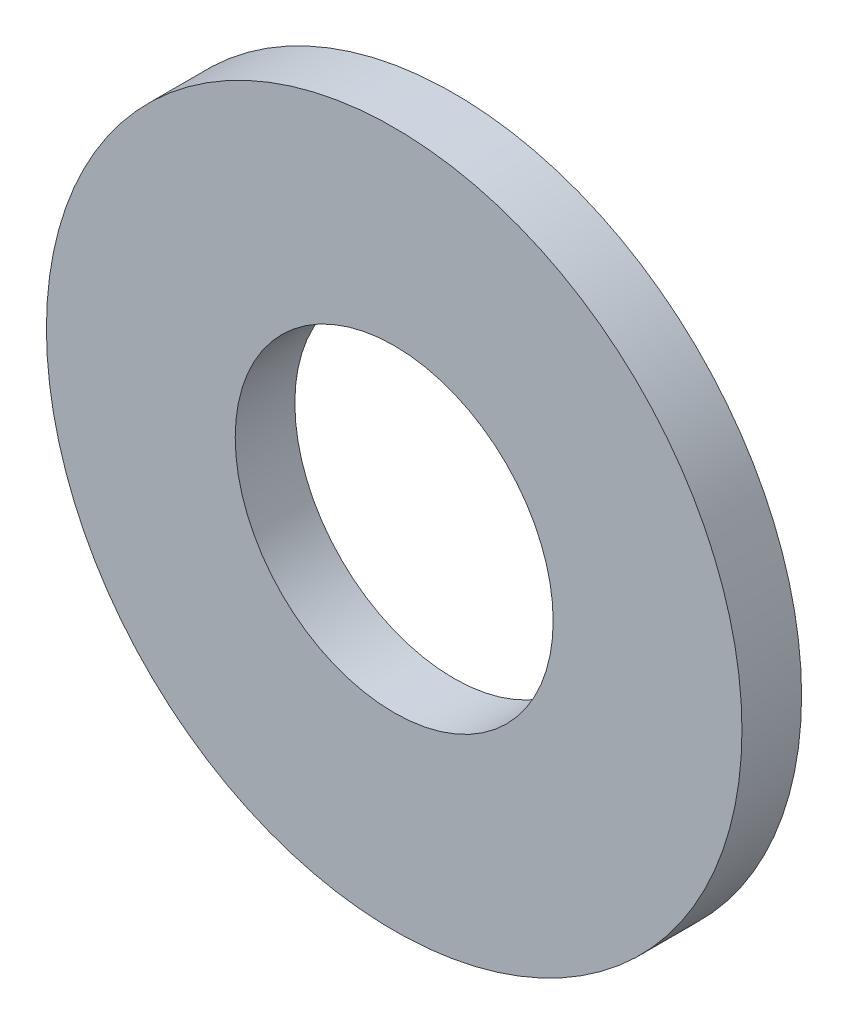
from build123d import *

# Parameters (mm, degrees)
E_CORPS_R              = 7
CORPS_DEPTH            = 1.2
E_PER_AGE_R            = 3.2
DIAM_TRE_NOMINAL_DEPTH = 10.97196069


with BuildPart() as part:
    # E_corps → Corps (new body)
    with BuildSketch(Plane.XY):
        Circle(E_CORPS_R)
    extrude(amount=CORPS_DEPTH)

    # E_per_age → Diam_tre_nominal (cut, through all)
    with BuildSketch(Plane(origin=(0, 0, 0), x_dir=(-1, 0, 0), z_dir=(0, 0, -1))):
        Circle(E_PER_AGE_R)
    extrude(amount=-DIAM_TRE_NOMINAL_DEPTH, mode=Mode.SUBTRACT)


solid = part.part
